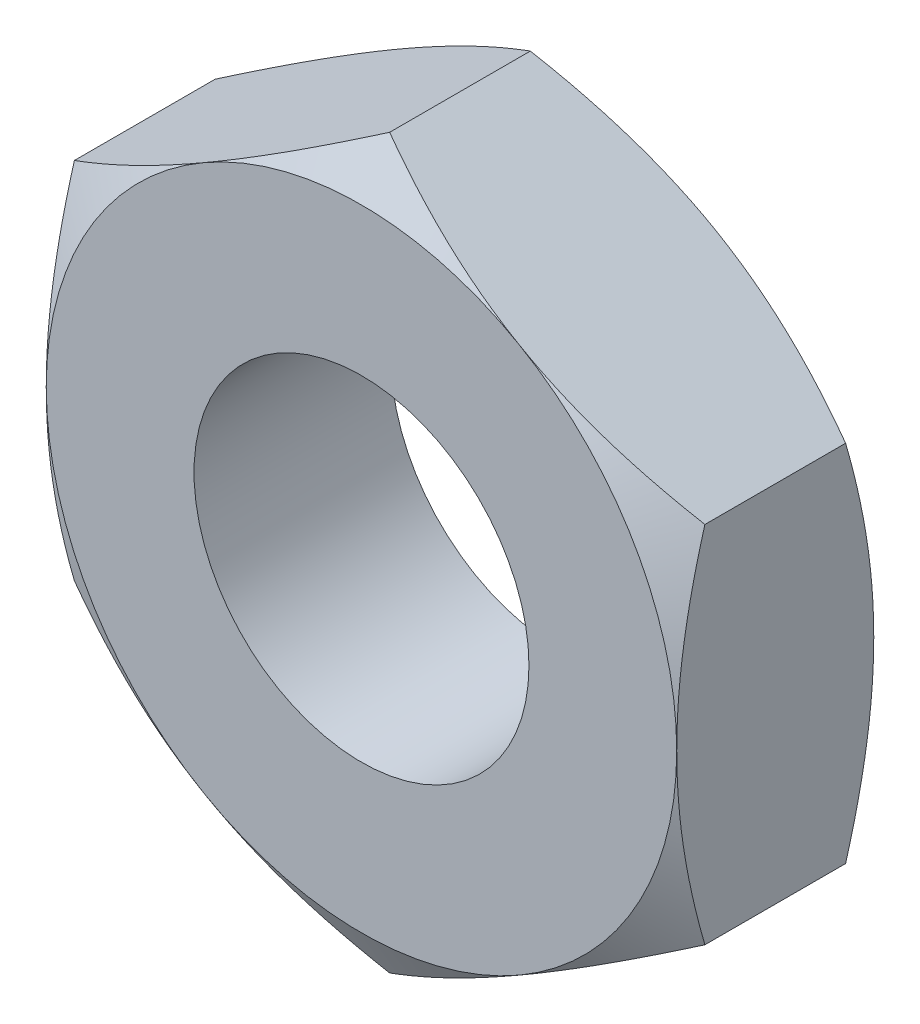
from build123d import *

# Parameters (mm, degrees)
BASENUTSKE_R       = 2.5
BASENUT_DEPTH      = 5
TROU_TARAUD_M101_D = 8.5


with BuildPart() as part:
    # BaseNutSke → BaseNut (new body)
    with BuildSketch(Plane.XY):
        Polygon((8, 4.618802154), (8, -4.618802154), (0, -9.237604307), (-8, -4.618802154), (-8, 4.618802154), (0, 9.237604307), align=None)
        Circle(BASENUTSKE_R, mode=Mode.SUBTRACT)
    extrude(amount=-BASENUT_DEPTH)

    # Esquisse1 → Enl_vement de mati_re-R_volution1 (revolve, cut)
    with BuildSketch(Plane(origin=(0, 0, 0), x_dir=(0, 0, -1), z_dir=(1, 0, 0))):
        Polygon((4.28546882, 9.237604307), (5, 8), (5, 9.237604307), align=None)
        Polygon((0, 9.237604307), (0, 8), (0.71453118, 9.237604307), align=None)
    revolve(axis=Axis((0, 0, -5), (0, 0, 1)), mode=Mode.SUBTRACT)

    # Trou taraud_ M101 (through all)
    with Locations(Plane.XY):
        with Locations((0, 0)):
            Hole(TROU_TARAUD_M101_D / 2)


solid = part.part
